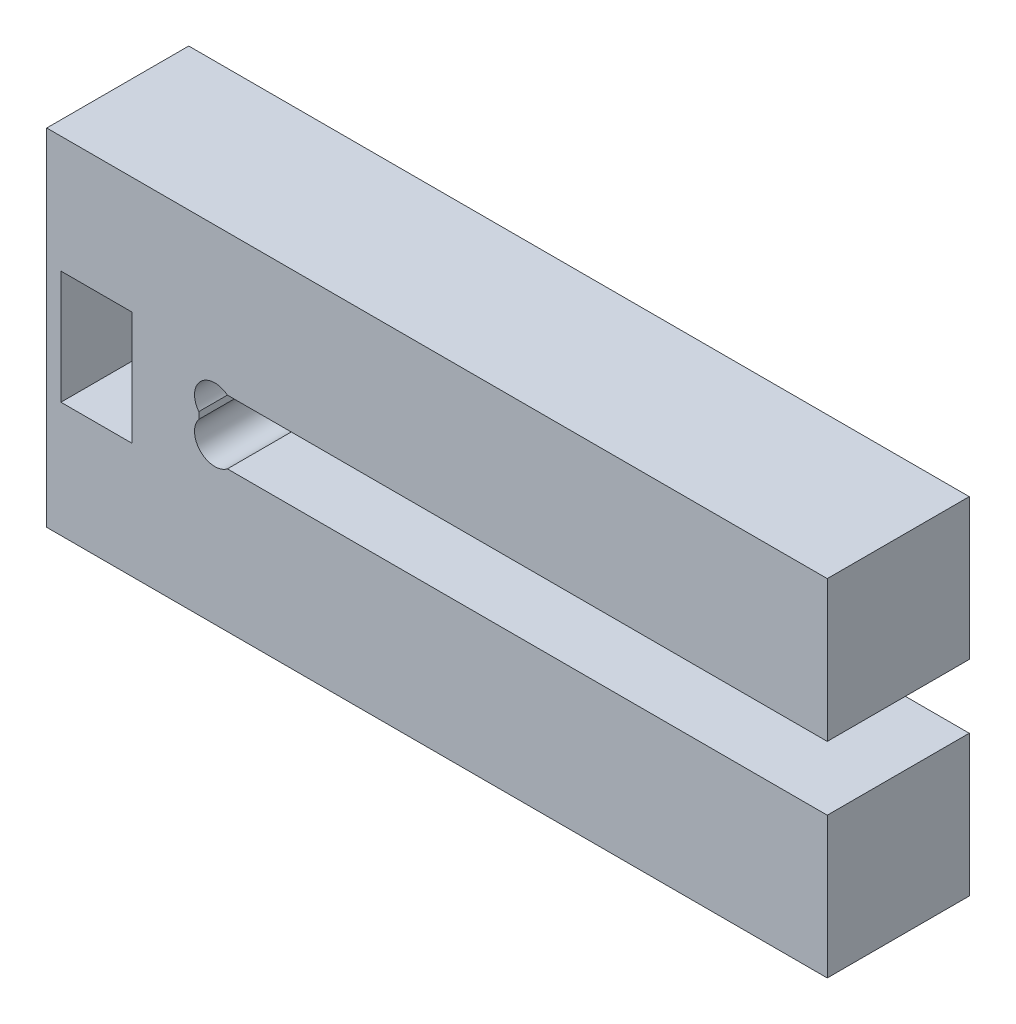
ISO-10303-21;
HEADER;
FILE_DESCRIPTION(('STEP AP214'),'2;1');
FILE_NAME('part.step','',(''),(''),'','','');
FILE_SCHEMA(('AUTOMOTIVE_DESIGN { 1 0 10303 214 1 1 1 1 }'));
ENDSEC;
DATA;
#1=APPLICATION_CONTEXT('core data for automotive mechanical design processes');
#2=APPLICATION_PROTOCOL_DEFINITION('international standard','automotive_design',2000,#1);
#3=PRODUCT_CONTEXT('',#1,'mechanical');
#4=PRODUCT('Part','Part','',(#3));
#5=PRODUCT_RELATED_PRODUCT_CATEGORY('part','',(#4));
#6=PRODUCT_DEFINITION_FORMATION('','',#4);
#7=PRODUCT_DEFINITION_CONTEXT('part definition',#1,'design');
#8=PRODUCT_DEFINITION('design','',#6,#7);
#9=PRODUCT_DEFINITION_SHAPE('','',#8);
#10=(LENGTH_UNIT() NAMED_UNIT(*) SI_UNIT(.MILLI.,.METRE.));
#11=(NAMED_UNIT(*) PLANE_ANGLE_UNIT() SI_UNIT($,.RADIAN.));
#12=(NAMED_UNIT(*) SI_UNIT($,.STERADIAN.) SOLID_ANGLE_UNIT());
#13=UNCERTAINTY_MEASURE_WITH_UNIT(LENGTH_MEASURE(1.E-05),#10,'distance_accuracy_value','');
#14=(GEOMETRIC_REPRESENTATION_CONTEXT(3) GLOBAL_UNCERTAINTY_ASSIGNED_CONTEXT((#13)) GLOBAL_UNIT_ASSIGNED_CONTEXT((#10,
#11,#12)) REPRESENTATION_CONTEXT('',''));
#15=CARTESIAN_POINT('',(0.,0.,0.));
#16=DIRECTION('',(0.,0.,1.));
#17=DIRECTION('',(1.,0.,0.));
#18=AXIS2_PLACEMENT_3D('',#15,#16,#17);
#19=CARTESIAN_POINT('',(-27.485,-12.18,10.));
#20=DIRECTION('',(0.,1.,0.));
#21=DIRECTION('',(0.,0.,1.));
#22=AXIS2_PLACEMENT_3D('',#19,#20,#21);
#23=PLANE('',#22);
#24=DIRECTION('',(1.,0.,0.));
#25=VECTOR('',#24,1.);
#26=CARTESIAN_POINT('',(-27.485,-12.18,0.));
#27=LINE('',#26,#25);
#28=CARTESIAN_POINT('',(-27.485,-12.18,0.));
#29=VERTEX_POINT('',#28);
#30=CARTESIAN_POINT('',(27.485,-12.18,0.));
#31=VERTEX_POINT('',#30);
#32=EDGE_CURVE('E152',#29,#31,#27,.T.);
#33=ORIENTED_EDGE('',*,*,#32,.T.);
#34=DIRECTION('',(0.,0.,-1.));
#35=VECTOR('',#34,1.);
#36=CARTESIAN_POINT('',(27.485,-12.18,10.));
#37=LINE('',#36,#35);
#38=CARTESIAN_POINT('',(27.485,-12.18,10.));
#39=VERTEX_POINT('',#38);
#40=EDGE_CURVE('E11',#39,#31,#37,.T.);
#41=ORIENTED_EDGE('',*,*,#40,.F.);
#42=DIRECTION('',(1.,0.,0.));
#43=VECTOR('',#42,1.);
#44=CARTESIAN_POINT('',(-27.485,-12.18,10.));
#45=LINE('',#44,#43);
#46=CARTESIAN_POINT('',(-27.485,-12.18,10.));
#47=VERTEX_POINT('',#46);
#48=EDGE_CURVE('E172',#47,#39,#45,.T.);
#49=ORIENTED_EDGE('',*,*,#48,.F.);
#50=DIRECTION('',(0.,0.,-1.));
#51=VECTOR('',#50,1.);
#52=CARTESIAN_POINT('',(-27.485,-12.18,10.));
#53=LINE('',#52,#51);
#54=EDGE_CURVE('E148',#47,#29,#53,.T.);
#55=ORIENTED_EDGE('',*,*,#54,.T.);
#56=EDGE_LOOP('',(#33,#41,#49,#55));
#57=FACE_BOUND('',#56,.T.);
#58=ADVANCED_FACE('F32',(#57),#23,.F.);
#59=CARTESIAN_POINT('',(27.485,-2.25,10.));
#60=DIRECTION('',(-1.,0.,0.));
#61=DIRECTION('',(0.,-1.,0.));
#62=AXIS2_PLACEMENT_3D('',#59,#60,#61);
#63=PLANE('',#62);
#64=DIRECTION('',(0.,1.,0.));
#65=VECTOR('',#64,1.);
#66=CARTESIAN_POINT('',(27.485,-2.25,0.));
#67=LINE('',#66,#65);
#68=CARTESIAN_POINT('',(27.485,-2.25,0.));
#69=VERTEX_POINT('',#68);
#70=EDGE_CURVE('E155',#31,#69,#67,.T.);
#71=ORIENTED_EDGE('',*,*,#70,.T.);
#72=DIRECTION('',(0.,0.,-1.));
#73=VECTOR('',#72,1.);
#74=CARTESIAN_POINT('',(27.485,-2.25,10.));
#75=LINE('',#74,#73);
#76=CARTESIAN_POINT('',(27.485,-2.25,10.));
#77=VERTEX_POINT('',#76);
#78=EDGE_CURVE('E39',#77,#69,#75,.T.);
#79=ORIENTED_EDGE('',*,*,#78,.F.);
#80=DIRECTION('',(0.,1.,0.));
#81=VECTOR('',#80,1.);
#82=CARTESIAN_POINT('',(27.485,-2.25,10.));
#83=LINE('',#82,#81);
#84=EDGE_CURVE('E102',#39,#77,#83,.T.);
#85=ORIENTED_EDGE('',*,*,#84,.F.);
#86=ORIENTED_EDGE('',*,*,#40,.T.);
#87=EDGE_LOOP('',(#71,#79,#85,#86));
#88=FACE_BOUND('',#87,.T.);
#89=ADVANCED_FACE('F289',(#88),#63,.F.);
#90=CARTESIAN_POINT('',(27.485,-2.25,10.));
#91=DIRECTION('',(0.,-1.,0.));
#92=DIRECTION('',(1.,0.,0.));
#93=AXIS2_PLACEMENT_3D('',#90,#91,#92);
#94=PLANE('',#93);
#95=DIRECTION('',(-1.,0.,0.));
#96=VECTOR('',#95,1.);
#97=CARTESIAN_POINT('',(27.485,-2.25,0.));
#98=LINE('',#97,#96);
#99=CARTESIAN_POINT('',(-14.762258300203,-2.25,0.));
#100=VERTEX_POINT('',#99);
#101=EDGE_CURVE('E158',#69,#100,#98,.T.);
#102=ORIENTED_EDGE('',*,*,#101,.T.);
#103=DIRECTION('',(0.,0.,-1.));
#104=VECTOR('',#103,1.);
#105=CARTESIAN_POINT('',(-14.762258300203,-2.25,10.));
#106=LINE('',#105,#104);
#107=CARTESIAN_POINT('',(-14.762258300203,-2.25,10.));
#108=VERTEX_POINT('',#107);
#109=EDGE_CURVE('E185',#108,#100,#106,.T.);
#110=ORIENTED_EDGE('',*,*,#109,.F.);
#111=DIRECTION('',(-1.,0.,0.));
#112=VECTOR('',#111,1.);
#113=CARTESIAN_POINT('',(27.485,-2.25,10.));
#114=LINE('',#113,#112);
#115=EDGE_CURVE('E193',#77,#108,#114,.T.);
#116=ORIENTED_EDGE('',*,*,#115,.F.);
#117=ORIENTED_EDGE('',*,*,#78,.T.);
#118=EDGE_LOOP('',(#102,#110,#116,#117));
#119=FACE_BOUND('',#118,.T.);
#120=ADVANCED_FACE('F191',(#119),#94,.F.);
#121=CARTESIAN_POINT('',(-15.6436291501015,-1.11862915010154,10.));
#122=DIRECTION('',(0.,0.,-1.));
#123=DIRECTION('',(-1.,0.,0.));
#124=AXIS2_PLACEMENT_3D('',#121,#122,#123);
#125=CYLINDRICAL_SURFACE('',#124,1.43415988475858);
#126=CARTESIAN_POINT('',(-15.6436291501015,-1.11862915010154,0.));
#127=DIRECTION('',(0.,0.,-1.));
#128=DIRECTION('',(-1.,0.,0.));
#129=AXIS2_PLACEMENT_3D('',#126,#127,#128);
#130=CIRCLE('',#129,1.43415988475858);
#131=CARTESIAN_POINT('',(-16.775,-0.237258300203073,0.));
#132=VERTEX_POINT('',#131);
#133=EDGE_CURVE('E160',#100,#132,#130,.T.);
#134=ORIENTED_EDGE('',*,*,#133,.T.);
#135=DIRECTION('',(0.,0.,-1.));
#136=VECTOR('',#135,1.);
#137=CARTESIAN_POINT('',(-16.775,-0.237258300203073,10.));
#138=LINE('',#137,#136);
#139=CARTESIAN_POINT('',(-16.775,-0.237258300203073,10.));
#140=VERTEX_POINT('',#139);
#141=EDGE_CURVE('E182',#140,#132,#138,.T.);
#142=ORIENTED_EDGE('',*,*,#141,.F.);
#143=CARTESIAN_POINT('',(-15.6436291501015,-1.11862915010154,10.));
#144=DIRECTION('',(0.,0.,-1.));
#145=DIRECTION('',(-1.,0.,0.));
#146=AXIS2_PLACEMENT_3D('',#143,#144,#145);
#147=CIRCLE('',#146,1.43415988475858);
#148=EDGE_CURVE('E211',#108,#140,#147,.T.);
#149=ORIENTED_EDGE('',*,*,#148,.F.);
#150=ORIENTED_EDGE('',*,*,#109,.T.);
#151=EDGE_LOOP('',(#134,#142,#149,#150));
#152=FACE_BOUND('',#151,.T.);
#153=ADVANCED_FACE('F202',(#152),#125,.F.);
#154=CARTESIAN_POINT('',(-16.775,0.237258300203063,10.));
#155=DIRECTION('',(-1.,0.,0.));
#156=DIRECTION('',(0.,0.,1.));
#157=AXIS2_PLACEMENT_3D('',#154,#155,#156);
#158=PLANE('',#157);
#159=DIRECTION('',(0.,1.,0.));
#160=VECTOR('',#159,1.);
#161=CARTESIAN_POINT('',(-16.775,0.237258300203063,0.));
#162=LINE('',#161,#160);
#163=CARTESIAN_POINT('',(-16.775,0.237258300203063,0.));
#164=VERTEX_POINT('',#163);
#165=EDGE_CURVE('E162',#132,#164,#162,.T.);
#166=ORIENTED_EDGE('',*,*,#165,.T.);
#167=DIRECTION('',(0.,0.,-1.));
#168=VECTOR('',#167,1.);
#169=CARTESIAN_POINT('',(-16.775,0.237258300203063,10.));
#170=LINE('',#169,#168);
#171=CARTESIAN_POINT('',(-16.775,0.237258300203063,10.));
#172=VERTEX_POINT('',#171);
#173=EDGE_CURVE('E179',#172,#164,#170,.T.);
#174=ORIENTED_EDGE('',*,*,#173,.F.);
#175=DIRECTION('',(0.,1.,0.));
#176=VECTOR('',#175,1.);
#177=CARTESIAN_POINT('',(-16.775,0.237258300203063,10.));
#178=LINE('',#177,#176);
#179=EDGE_CURVE('E208',#140,#172,#178,.T.);
#180=ORIENTED_EDGE('',*,*,#179,.F.);
#181=ORIENTED_EDGE('',*,*,#141,.T.);
#182=EDGE_LOOP('',(#166,#174,#180,#181));
#183=FACE_BOUND('',#182,.T.);
#184=ADVANCED_FACE('F206',(#183),#158,.F.);
#185=CARTESIAN_POINT('',(-15.6436291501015,1.11862915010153,10.));
#186=DIRECTION('',(0.,0.,-1.));
#187=DIRECTION('',(-1.,0.,0.));
#188=AXIS2_PLACEMENT_3D('',#185,#186,#187);
#189=CYLINDRICAL_SURFACE('',#188,1.43415988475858);
#190=CARTESIAN_POINT('',(-15.6436291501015,1.11862915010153,0.));
#191=DIRECTION('',(0.,0.,-1.));
#192=DIRECTION('',(1.,0.,0.));
#193=AXIS2_PLACEMENT_3D('',#190,#191,#192);
#194=CIRCLE('',#193,1.43415988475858);
#195=CARTESIAN_POINT('',(-14.762258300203,2.25,0.));
#196=VERTEX_POINT('',#195);
#197=EDGE_CURVE('E164',#164,#196,#194,.T.);
#198=ORIENTED_EDGE('',*,*,#197,.T.);
#199=DIRECTION('',(0.,0.,-1.));
#200=VECTOR('',#199,1.);
#201=CARTESIAN_POINT('',(-14.762258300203,2.25,10.));
#202=LINE('',#201,#200);
#203=CARTESIAN_POINT('',(-14.762258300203,2.25,10.));
#204=VERTEX_POINT('',#203);
#205=EDGE_CURVE('E176',#204,#196,#202,.T.);
#206=ORIENTED_EDGE('',*,*,#205,.F.);
#207=CARTESIAN_POINT('',(-15.6436291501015,1.11862915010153,10.));
#208=DIRECTION('',(0.,0.,-1.));
#209=DIRECTION('',(1.,0.,0.));
#210=AXIS2_PLACEMENT_3D('',#207,#208,#209);
#211=CIRCLE('',#210,1.43415988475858);
#212=EDGE_CURVE('E210',#172,#204,#211,.T.);
#213=ORIENTED_EDGE('',*,*,#212,.F.);
#214=ORIENTED_EDGE('',*,*,#173,.T.);
#215=EDGE_LOOP('',(#198,#206,#213,#214));
#216=FACE_BOUND('',#215,.T.);
#217=ADVANCED_FACE('F313',(#216),#189,.F.);
#218=CARTESIAN_POINT('',(27.485,2.25,10.));
#219=DIRECTION('',(0.,1.,0.));
#220=DIRECTION('',(-1.,0.,0.));
#221=AXIS2_PLACEMENT_3D('',#218,#219,#220);
#222=PLANE('',#221);
#223=DIRECTION('',(1.,0.,0.));
#224=VECTOR('',#223,1.);
#225=CARTESIAN_POINT('',(27.485,2.25,0.));
#226=LINE('',#225,#224);
#227=CARTESIAN_POINT('',(27.485,2.25,0.));
#228=VERTEX_POINT('',#227);
#229=EDGE_CURVE('E166',#196,#228,#226,.T.);
#230=ORIENTED_EDGE('',*,*,#229,.T.);
#231=DIRECTION('',(0.,0.,-1.));
#232=VECTOR('',#231,1.);
#233=CARTESIAN_POINT('',(27.485,2.25,10.));
#234=LINE('',#233,#232);
#235=CARTESIAN_POINT('',(27.485,2.25,10.));
#236=VERTEX_POINT('',#235);
#237=EDGE_CURVE('E143',#236,#228,#234,.T.);
#238=ORIENTED_EDGE('',*,*,#237,.F.);
#239=DIRECTION('',(1.,0.,0.));
#240=VECTOR('',#239,1.);
#241=CARTESIAN_POINT('',(27.485,2.25,10.));
#242=LINE('',#241,#240);
#243=EDGE_CURVE('E131',#204,#236,#242,.T.);
#244=ORIENTED_EDGE('',*,*,#243,.F.);
#245=ORIENTED_EDGE('',*,*,#205,.T.);
#246=EDGE_LOOP('',(#230,#238,#244,#245));
#247=FACE_BOUND('',#246,.T.);
#248=ADVANCED_FACE('F310',(#247),#222,.F.);
#249=CARTESIAN_POINT('',(27.485,12.18,10.));
#250=DIRECTION('',(-1.,0.,0.));
#251=DIRECTION('',(0.,-1.,0.));
#252=AXIS2_PLACEMENT_3D('',#249,#250,#251);
#253=PLANE('',#252);
#254=DIRECTION('',(0.,1.,0.));
#255=VECTOR('',#254,1.);
#256=CARTESIAN_POINT('',(27.485,12.18,0.));
#257=LINE('',#256,#255);
#258=CARTESIAN_POINT('',(27.485,12.18,0.));
#259=VERTEX_POINT('',#258);
#260=EDGE_CURVE('E140',#228,#259,#257,.T.);
#261=ORIENTED_EDGE('',*,*,#260,.T.);
#262=DIRECTION('',(0.,0.,-1.));
#263=VECTOR('',#262,1.);
#264=CARTESIAN_POINT('',(27.485,12.18,10.));
#265=LINE('',#264,#263);
#266=CARTESIAN_POINT('',(27.485,12.18,10.));
#267=VERTEX_POINT('',#266);
#268=EDGE_CURVE('E137',#267,#259,#265,.T.);
#269=ORIENTED_EDGE('',*,*,#268,.F.);
#270=DIRECTION('',(0.,1.,0.));
#271=VECTOR('',#270,1.);
#272=CARTESIAN_POINT('',(27.485,12.18,10.));
#273=LINE('',#272,#271);
#274=EDGE_CURVE('E124',#236,#267,#273,.T.);
#275=ORIENTED_EDGE('',*,*,#274,.F.);
#276=ORIENTED_EDGE('',*,*,#237,.T.);
#277=EDGE_LOOP('',(#261,#269,#275,#276));
#278=FACE_BOUND('',#277,.T.);
#279=ADVANCED_FACE('F138',(#278),#253,.F.);
#280=CARTESIAN_POINT('',(-27.485,12.18,10.));
#281=DIRECTION('',(0.,-1.,0.));
#282=DIRECTION('',(0.,0.,-1.));
#283=AXIS2_PLACEMENT_3D('',#280,#281,#282);
#284=PLANE('',#283);
#285=DIRECTION('',(-1.,0.,0.));
#286=VECTOR('',#285,1.);
#287=CARTESIAN_POINT('',(-27.485,12.18,0.));
#288=LINE('',#287,#286);
#289=CARTESIAN_POINT('',(-27.485,12.18,0.));
#290=VERTEX_POINT('',#289);
#291=EDGE_CURVE('E169',#259,#290,#288,.T.);
#292=ORIENTED_EDGE('',*,*,#291,.T.);
#293=DIRECTION('',(0.,0.,-1.));
#294=VECTOR('',#293,1.);
#295=CARTESIAN_POINT('',(-27.485,12.18,10.));
#296=LINE('',#295,#294);
#297=CARTESIAN_POINT('',(-27.485,12.18,10.));
#298=VERTEX_POINT('',#297);
#299=EDGE_CURVE('E144',#298,#290,#296,.T.);
#300=ORIENTED_EDGE('',*,*,#299,.F.);
#301=DIRECTION('',(-1.,0.,0.));
#302=VECTOR('',#301,1.);
#303=CARTESIAN_POINT('',(-27.485,12.18,10.));
#304=LINE('',#303,#302);
#305=EDGE_CURVE('E128',#267,#298,#304,.T.);
#306=ORIENTED_EDGE('',*,*,#305,.F.);
#307=ORIENTED_EDGE('',*,*,#268,.T.);
#308=EDGE_LOOP('',(#292,#300,#306,#307));
#309=FACE_BOUND('',#308,.T.);
#310=ADVANCED_FACE('F146',(#309),#284,.F.);
#311=CARTESIAN_POINT('',(-27.485,12.18,10.));
#312=DIRECTION('',(1.,0.,0.));
#313=DIRECTION('',(0.,1.,0.));
#314=AXIS2_PLACEMENT_3D('',#311,#312,#313);
#315=PLANE('',#314);
#316=DIRECTION('',(0.,-1.,0.));
#317=VECTOR('',#316,1.);
#318=CARTESIAN_POINT('',(-27.485,12.18,0.));
#319=LINE('',#318,#317);
#320=EDGE_CURVE('E94',#290,#29,#319,.T.);
#321=ORIENTED_EDGE('',*,*,#320,.T.);
#322=ORIENTED_EDGE('',*,*,#54,.F.);
#323=DIRECTION('',(0.,-1.,0.));
#324=VECTOR('',#323,1.);
#325=CARTESIAN_POINT('',(-27.485,12.18,10.));
#326=LINE('',#325,#324);
#327=EDGE_CURVE('E55',#298,#47,#326,.T.);
#328=ORIENTED_EDGE('',*,*,#327,.F.);
#329=ORIENTED_EDGE('',*,*,#299,.T.);
#330=EDGE_LOOP('',(#321,#322,#328,#329));
#331=FACE_BOUND('',#330,.T.);
#332=ADVANCED_FACE('F297',(#331),#315,.F.);
#333=CARTESIAN_POINT('',(-15.6436291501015,-1.11862915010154,10.));
#334=DIRECTION('',(0.,0.,-1.));
#335=DIRECTION('',(-1.,0.,0.));
#336=AXIS2_PLACEMENT_3D('',#333,#334,#335);
#337=PLANE('',#336);
#338=DIRECTION('',(1.,0.,0.));
#339=VECTOR('',#338,1.);
#340=CARTESIAN_POINT('',(-26.485,-4.047282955,10.));
#341=LINE('',#340,#339);
#342=CARTESIAN_POINT('',(-26.485,-4.047282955,10.));
#343=VERTEX_POINT('',#342);
#344=CARTESIAN_POINT('',(-21.485,-4.047282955,10.));
#345=VERTEX_POINT('',#344);
#346=EDGE_CURVE('E236',#343,#345,#341,.T.);
#347=ORIENTED_EDGE('',*,*,#346,.F.);
#348=DIRECTION('',(0.,-1.,0.));
#349=VECTOR('',#348,1.);
#350=CARTESIAN_POINT('',(-26.485,3.952717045,10.));
#351=LINE('',#350,#349);
#352=CARTESIAN_POINT('',(-26.485,3.952717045,10.));
#353=VERTEX_POINT('',#352);
#354=EDGE_CURVE('E46',#353,#343,#351,.T.);
#355=ORIENTED_EDGE('',*,*,#354,.F.);
#356=DIRECTION('',(-1.,0.,0.));
#357=VECTOR('',#356,1.);
#358=CARTESIAN_POINT('',(-26.485,3.952717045,10.));
#359=LINE('',#358,#357);
#360=CARTESIAN_POINT('',(-21.485,3.952717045,10.));
#361=VERTEX_POINT('',#360);
#362=EDGE_CURVE('E229',#361,#353,#359,.T.);
#363=ORIENTED_EDGE('',*,*,#362,.F.);
#364=DIRECTION('',(0.,1.,0.));
#365=VECTOR('',#364,1.);
#366=CARTESIAN_POINT('',(-21.485,3.952717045,10.));
#367=LINE('',#366,#365);
#368=EDGE_CURVE('E233',#345,#361,#367,.T.);
#369=ORIENTED_EDGE('',*,*,#368,.F.);
#370=EDGE_LOOP('',(#347,#355,#363,#369));
#371=FACE_BOUND('',#370,.T.);
#372=ORIENTED_EDGE('',*,*,#48,.T.);
#373=ORIENTED_EDGE('',*,*,#84,.T.);
#374=ORIENTED_EDGE('',*,*,#115,.T.);
#375=ORIENTED_EDGE('',*,*,#148,.T.);
#376=ORIENTED_EDGE('',*,*,#179,.T.);
#377=ORIENTED_EDGE('',*,*,#212,.T.);
#378=ORIENTED_EDGE('',*,*,#243,.T.);
#379=ORIENTED_EDGE('',*,*,#274,.T.);
#380=ORIENTED_EDGE('',*,*,#305,.T.);
#381=ORIENTED_EDGE('',*,*,#327,.T.);
#382=EDGE_LOOP('',(#372,#373,#374,#375,#376,#377,#378,#379,#380,#381));
#383=FACE_BOUND('',#382,.T.);
#384=ADVANCED_FACE('F126',(#371,#383),#337,.F.);
#385=CARTESIAN_POINT('',(-15.6436291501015,-1.11862915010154,0.));
#386=DIRECTION('',(0.,0.,-1.));
#387=DIRECTION('',(-1.,0.,0.));
#388=AXIS2_PLACEMENT_3D('',#385,#386,#387);
#389=PLANE('',#388);
#390=ORIENTED_EDGE('',*,*,#32,.F.);
#391=ORIENTED_EDGE('',*,*,#320,.F.);
#392=ORIENTED_EDGE('',*,*,#291,.F.);
#393=ORIENTED_EDGE('',*,*,#260,.F.);
#394=ORIENTED_EDGE('',*,*,#229,.F.);
#395=ORIENTED_EDGE('',*,*,#197,.F.);
#396=ORIENTED_EDGE('',*,*,#165,.F.);
#397=ORIENTED_EDGE('',*,*,#133,.F.);
#398=ORIENTED_EDGE('',*,*,#101,.F.);
#399=ORIENTED_EDGE('',*,*,#70,.F.);
#400=EDGE_LOOP('',(#390,#391,#392,#393,#394,#395,#396,#397,#398,#399));
#401=FACE_BOUND('',#400,.T.);
#402=ADVANCED_FACE('F197',(#401),#389,.T.);
#403=CARTESIAN_POINT('',(-26.485,3.952717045,1.));
#404=DIRECTION('',(-1.,0.,0.));
#405=DIRECTION('',(0.,0.,1.));
#406=AXIS2_PLACEMENT_3D('',#403,#404,#405);
#407=PLANE('',#406);
#408=ORIENTED_EDGE('',*,*,#354,.T.);
#409=DIRECTION('',(0.,0.,1.));
#410=VECTOR('',#409,1.);
#411=CARTESIAN_POINT('',(-26.485,-4.047282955,1.));
#412=LINE('',#411,#410);
#413=CARTESIAN_POINT('',(-26.485,-4.047282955,1.));
#414=VERTEX_POINT('',#413);
#415=EDGE_CURVE('E219',#414,#343,#412,.T.);
#416=ORIENTED_EDGE('',*,*,#415,.F.);
#417=DIRECTION('',(0.,-1.,0.));
#418=VECTOR('',#417,1.);
#419=CARTESIAN_POINT('',(-26.485,3.952717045,1.));
#420=LINE('',#419,#418);
#421=CARTESIAN_POINT('',(-26.485,3.952717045,1.));
#422=VERTEX_POINT('',#421);
#423=EDGE_CURVE('E232',#422,#414,#420,.T.);
#424=ORIENTED_EDGE('',*,*,#423,.F.);
#425=DIRECTION('',(0.,0.,1.));
#426=VECTOR('',#425,1.);
#427=CARTESIAN_POINT('',(-26.485,3.952717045,1.));
#428=LINE('',#427,#426);
#429=EDGE_CURVE('E156',#422,#353,#428,.T.);
#430=ORIENTED_EDGE('',*,*,#429,.T.);
#431=EDGE_LOOP('',(#408,#416,#424,#430));
#432=FACE_BOUND('',#431,.T.);
#433=ADVANCED_FACE('F257',(#432),#407,.F.);
#434=CARTESIAN_POINT('',(-26.485,3.952717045,1.));
#435=DIRECTION('',(0.,1.,0.));
#436=DIRECTION('',(-1.,0.,0.));
#437=AXIS2_PLACEMENT_3D('',#434,#435,#436);
#438=PLANE('',#437);
#439=ORIENTED_EDGE('',*,*,#362,.T.);
#440=ORIENTED_EDGE('',*,*,#429,.F.);
#441=DIRECTION('',(-1.,0.,0.));
#442=VECTOR('',#441,1.);
#443=CARTESIAN_POINT('',(-26.485,3.952717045,1.));
#444=LINE('',#443,#442);
#445=CARTESIAN_POINT('',(-21.485,3.952717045,1.));
#446=VERTEX_POINT('',#445);
#447=EDGE_CURVE('E222',#446,#422,#444,.T.);
#448=ORIENTED_EDGE('',*,*,#447,.F.);
#449=DIRECTION('',(0.,0.,1.));
#450=VECTOR('',#449,1.);
#451=CARTESIAN_POINT('',(-21.485,3.952717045,1.));
#452=LINE('',#451,#450);
#453=EDGE_CURVE('E225',#446,#361,#452,.T.);
#454=ORIENTED_EDGE('',*,*,#453,.T.);
#455=EDGE_LOOP('',(#439,#440,#448,#454));
#456=FACE_BOUND('',#455,.T.);
#457=ADVANCED_FACE('F268',(#456),#438,.F.);
#458=CARTESIAN_POINT('',(-21.485,3.952717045,1.));
#459=DIRECTION('',(1.,0.,0.));
#460=DIRECTION('',(0.,0.,-1.));
#461=AXIS2_PLACEMENT_3D('',#458,#459,#460);
#462=PLANE('',#461);
#463=ORIENTED_EDGE('',*,*,#368,.T.);
#464=ORIENTED_EDGE('',*,*,#453,.F.);
#465=DIRECTION('',(0.,1.,0.));
#466=VECTOR('',#465,1.);
#467=CARTESIAN_POINT('',(-21.485,3.952717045,1.));
#468=LINE('',#467,#466);
#469=CARTESIAN_POINT('',(-21.485,-4.047282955,1.));
#470=VERTEX_POINT('',#469);
#471=EDGE_CURVE('E242',#470,#446,#468,.T.);
#472=ORIENTED_EDGE('',*,*,#471,.F.);
#473=DIRECTION('',(0.,0.,1.));
#474=VECTOR('',#473,1.);
#475=CARTESIAN_POINT('',(-21.485,-4.047282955,1.));
#476=LINE('',#475,#474);
#477=EDGE_CURVE('E221',#470,#345,#476,.T.);
#478=ORIENTED_EDGE('',*,*,#477,.T.);
#479=EDGE_LOOP('',(#463,#464,#472,#478));
#480=FACE_BOUND('',#479,.T.);
#481=ADVANCED_FACE('F273',(#480),#462,.F.);
#482=CARTESIAN_POINT('',(-26.485,-4.047282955,1.));
#483=DIRECTION('',(0.,-1.,0.));
#484=DIRECTION('',(0.,0.,-1.));
#485=AXIS2_PLACEMENT_3D('',#482,#483,#484);
#486=PLANE('',#485);
#487=ORIENTED_EDGE('',*,*,#346,.T.);
#488=ORIENTED_EDGE('',*,*,#477,.F.);
#489=DIRECTION('',(1.,0.,0.));
#490=VECTOR('',#489,1.);
#491=CARTESIAN_POINT('',(-26.485,-4.047282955,1.));
#492=LINE('',#491,#490);
#493=EDGE_CURVE('E245',#414,#470,#492,.T.);
#494=ORIENTED_EDGE('',*,*,#493,.F.);
#495=ORIENTED_EDGE('',*,*,#415,.T.);
#496=EDGE_LOOP('',(#487,#488,#494,#495));
#497=FACE_BOUND('',#496,.T.);
#498=ADVANCED_FACE('F278',(#497),#486,.F.);
#499=CARTESIAN_POINT('',(0.,0.,1.));
#500=DIRECTION('',(0.,0.,1.));
#501=DIRECTION('',(1.,0.,0.));
#502=AXIS2_PLACEMENT_3D('',#499,#500,#501);
#503=PLANE('',#502);
#504=ORIENTED_EDGE('',*,*,#423,.T.);
#505=ORIENTED_EDGE('',*,*,#493,.T.);
#506=ORIENTED_EDGE('',*,*,#471,.T.);
#507=ORIENTED_EDGE('',*,*,#447,.T.);
#508=EDGE_LOOP('',(#504,#505,#506,#507));
#509=FACE_BOUND('',#508,.T.);
#510=ADVANCED_FACE('F252',(#509),#503,.T.);
#511=CLOSED_SHELL('',(#58,#89,#120,#153,#184,#217,#248,#279,#310,#332,#384,#402,#433,#457,#481,
#498,#510));
#512=MANIFOLD_SOLID_BREP('B2',#511);
#513=ADVANCED_BREP_SHAPE_REPRESENTATION('',(#18,#512),#14);
#514=SHAPE_DEFINITION_REPRESENTATION(#9,#513);
ENDSEC;
END-ISO-10303-21;
